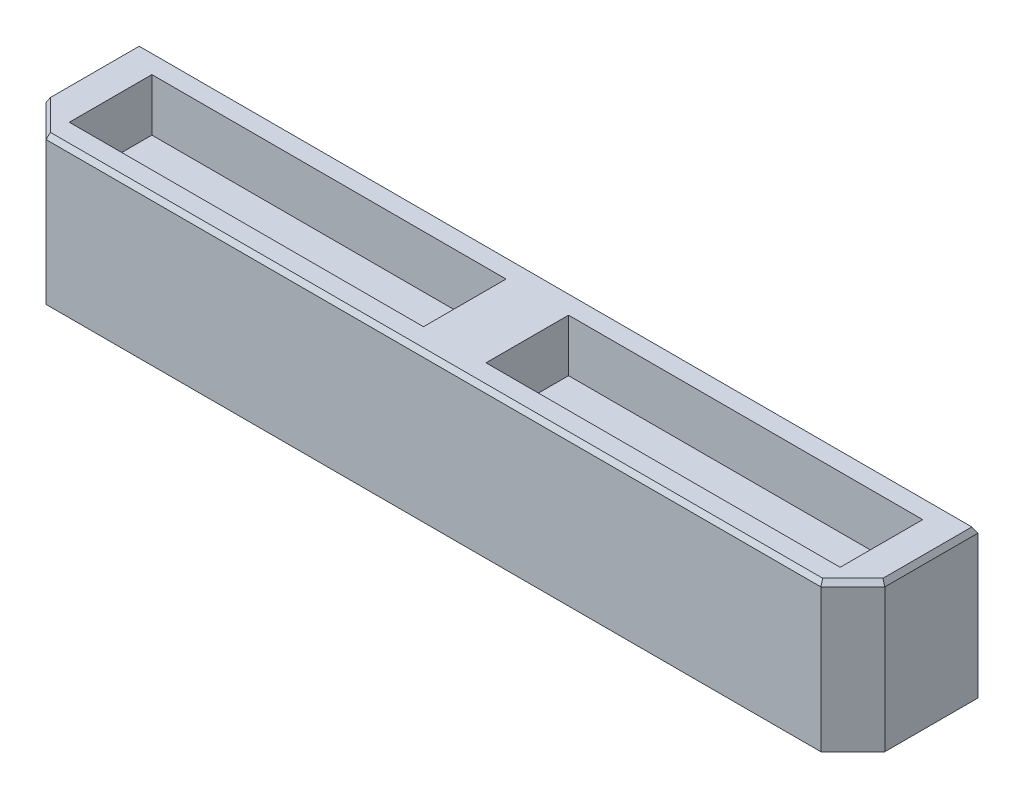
from build123d import *

# Parameters (mm, degrees)
SKETCH1_W          = 37.72535
SKETCH1_H          = 7.06374
EXTRUDE1_DEPTH     = 5.969
SKETCH4_W          = 5.969
SKETCH4_H          = 7.06374
EXTRUDE4_DEPTH     = 2.27965
SKETCH7_W          = 16.891
SKETCH7_H          = 3.937
CUT_EXTRUDE1_DEPTH = 2.5
CHAMFER1_SIZE      = 1.524
CHAMFER2_SIZE      = 1.524
CHAMFER3_SIZE      = 0.147
CHAMFER3_SIZE2     = 0.254


with BuildPart() as part:
    # Sketch1 → Extrude1 (new body)
    with BuildSketch(Plane.XY.offset(2.9845)):
        with Locations((-1.139825, 3.73507)):
            Rectangle(SKETCH1_W, SKETCH1_H)
    extrude(amount=-EXTRUDE1_DEPTH)

    # Sketch4 → Extrude4 (add)
    with BuildSketch(Plane(origin=(17.72285, 0, 0), x_dir=(0, 0, -1), z_dir=(1, 0, 0))):
        with Locations((0, 3.73507)):
            Rectangle(SKETCH4_W, SKETCH4_H)
    extrude(amount=EXTRUDE4_DEPTH)

    # Sketch7 → Cut-Extrude1 (cut)
    with BuildSketch(Plane(origin=(0, 7.26694, 0), x_dir=(-1, 0, 0), z_dir=(0, 1, 0))):
        with Locations((-9.936255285, 0)):
            Rectangle(SKETCH7_W, SKETCH7_H)
        with Locations((9.936255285, 0)):
            Rectangle(SKETCH7_W, SKETCH7_H)
    extrude(amount=-CUT_EXTRUDE1_DEPTH, mode=Mode.SUBTRACT)

    # Chamfer1
    chamfer1_edges = [part.edges().sort_by_distance(p)[0] for p in [
        (-20.0025, 3.73507, 2.9845),
    ]]
    chamfer(chamfer1_edges, length=CHAMFER1_SIZE)

    # Chamfer2
    chamfer2_edges = [part.edges().sort_by_distance(p)[0] for p in [
        (20.0025, 3.73507, 2.9845),
    ]]
    chamfer(chamfer2_edges, length=CHAMFER2_SIZE)

    # Chamfer3
    chamfer3_edges = [part.edges().sort_by_distance(p)[0] for p in [
        (0, 7.26694, -2.9845),
        (20.0025, 7.26694, -0.762),
        (-19.2405, 7.26694, 2.2225),
        (0, 7.26694, 2.9845),
        (19.2405, 7.26694, 2.2225),
        (-20.0025, 7.26694, -0.762),
    ]]
    chamfer3_side = [part.faces().sort_by_distance(p)[0] for p in [
        (0, 7.26694, -0.055590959),
    ]]
    chamfer(chamfer3_edges, length=CHAMFER3_SIZE, length2=CHAMFER3_SIZE2, reference=chamfer3_side[0])


solid = part.part
